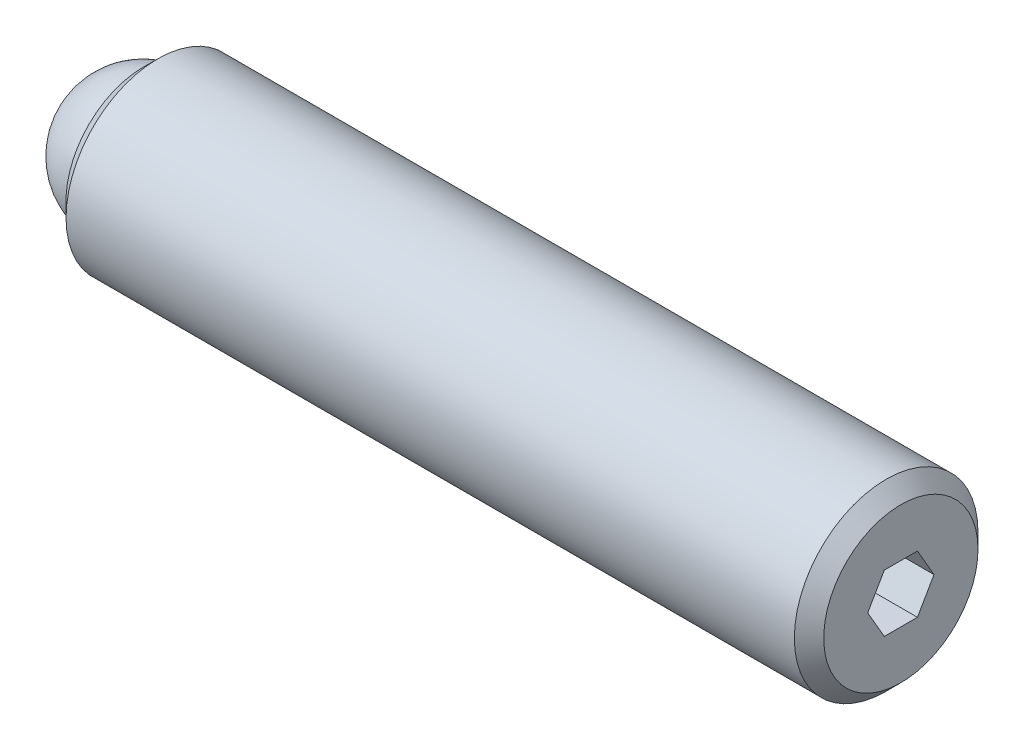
from build123d import *

# Parameters (mm, degrees)
SKETCH2_R           = 3.175
BOSS_EXTRUDE1_DEPTH = 26.19375
CHAMFER1_SIZE       = 0.508
CHAMFER2_SIZE       = 0.508
CUT_EXTRUDE2_DEPTH  = 2.286
SKETCH3_R           = 2.38125
CUT_EXTRUDE3_DEPTH  = 1.984375


with BuildPart() as part:
    # Sketch2 → Boss-Extrude1 (new body)
    with BuildSketch(Plane(origin=(0, 0, 0), x_dir=(0, 0, -1), z_dir=(1, 0, 0))):
        Circle(SKETCH2_R)
    extrude(amount=BOSS_EXTRUDE1_DEPTH)

    # Chamfer1
    chamfer1_edges = [part.edges().sort_by_distance(p)[0] for p in [
        (0, 0, 3.175),
    ]]
    chamfer(chamfer1_edges, length=CHAMFER1_SIZE)

    # Chamfer2
    chamfer2_edges = [part.edges().sort_by_distance(p)[0] for p in [
        (26.19375, 0, 3.175),
    ]]
    chamfer(chamfer2_edges, length=CHAMFER2_SIZE)

    # Sketch4 → Cut-Extrude2 (cut)
    with BuildSketch(Plane(origin=(26.19375, 0, 0), x_dir=(0, 0, -1), z_dir=(1, 0, 0))):
        Polygon((1.14567944, 0), (0.57283972, 0.9921875), (-0.57283972, 0.9921875), (-1.14567944, 0), (-0.57283972, -0.9921875), (0.57283972, -0.9921875), align=None)
    extrude(amount=-CUT_EXTRUDE2_DEPTH, mode=Mode.SUBTRACT)

    # Sketch3 → Cut-Extrude3 (cut)
    with BuildSketch(Plane.ZY):
        Circle(SKETCH3_R)
    extrude(amount=-CUT_EXTRUDE3_DEPTH, mode=Mode.SUBTRACT)


with BuildPart() as body_2:
    # Sketch5 → Revolve1 (revolve)
    with BuildSketch(Plane.ZY):
        with BuildLine():
            Line((0, 0), (0, -2.38125))
            ThreePointArc((0, -2.38125), (-2.38125, 0), (0, 2.38125))
            Line((0, 2.38125), (0, 0))
        make_face()
    revolve(axis=Axis((0, 0, 0), (0, 1, 0)))


solid = Compound([part.part, body_2.part])
